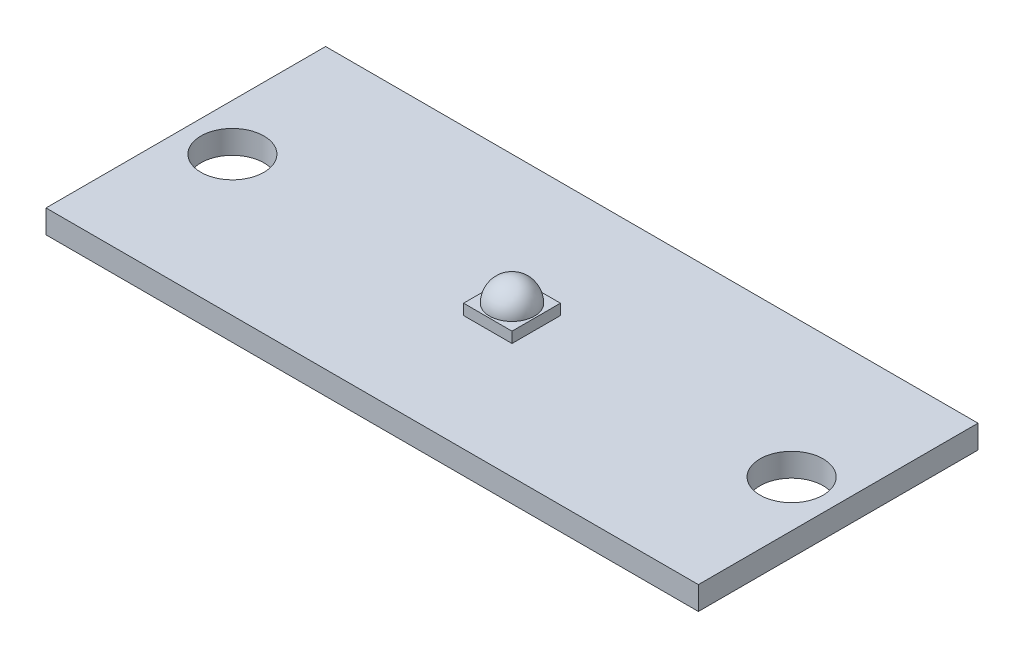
ISO-10303-21;
HEADER;
FILE_DESCRIPTION(('STEP AP214'),'2;1');
FILE_NAME('part.step','',(''),(''),'','','');
FILE_SCHEMA(('AUTOMOTIVE_DESIGN { 1 0 10303 214 1 1 1 1 }'));
ENDSEC;
DATA;
#1=APPLICATION_CONTEXT('core data for automotive mechanical design processes');
#2=APPLICATION_PROTOCOL_DEFINITION('international standard','automotive_design',2000,#1);
#3=PRODUCT_CONTEXT('',#1,'mechanical');
#4=PRODUCT('Part','Part','',(#3));
#5=PRODUCT_RELATED_PRODUCT_CATEGORY('part','',(#4));
#6=PRODUCT_DEFINITION_FORMATION('','',#4);
#7=PRODUCT_DEFINITION_CONTEXT('part definition',#1,'design');
#8=PRODUCT_DEFINITION('design','',#6,#7);
#9=PRODUCT_DEFINITION_SHAPE('','',#8);
#10=(LENGTH_UNIT() NAMED_UNIT(*) SI_UNIT(.MILLI.,.METRE.));
#11=(NAMED_UNIT(*) PLANE_ANGLE_UNIT() SI_UNIT($,.RADIAN.));
#12=(NAMED_UNIT(*) SI_UNIT($,.STERADIAN.) SOLID_ANGLE_UNIT());
#13=UNCERTAINTY_MEASURE_WITH_UNIT(LENGTH_MEASURE(1.E-05),#10,'distance_accuracy_value','');
#14=(GEOMETRIC_REPRESENTATION_CONTEXT(3) GLOBAL_UNCERTAINTY_ASSIGNED_CONTEXT((#13)) GLOBAL_UNIT_ASSIGNED_CONTEXT((#10,
#11,#12)) REPRESENTATION_CONTEXT('',''));
#15=CARTESIAN_POINT('',(0.,0.,0.));
#16=DIRECTION('',(0.,0.,1.));
#17=DIRECTION('',(1.,0.,0.));
#18=AXIS2_PLACEMENT_3D('',#15,#16,#17);
#19=CARTESIAN_POINT('',(0.,1.5875,0.));
#20=DIRECTION('',(0.,-1.,0.));
#21=DIRECTION('',(0.,0.,-1.));
#22=AXIS2_PLACEMENT_3D('',#19,#20,#21);
#23=PLANE('',#22);
#24=CARTESIAN_POINT('',(19.05,1.5875,0.));
#25=DIRECTION('',(0.,1.,0.));
#26=DIRECTION('',(0.,0.,1.));
#27=AXIS2_PLACEMENT_3D('',#24,#25,#26);
#28=CIRCLE('',#27,2.1463);
#29=CARTESIAN_POINT('',(19.05,1.5875,2.14629999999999));
#30=VERTEX_POINT('',#29);
#31=EDGE_CURVE('E123',#30,#30,#28,.T.);
#32=ORIENTED_EDGE('',*,*,#31,.F.);
#33=EDGE_LOOP('',(#32));
#34=FACE_BOUND('',#33,.T.);
#35=DIRECTION('',(0.,0.,-1.));
#36=VECTOR('',#35,1.);
#37=CARTESIAN_POINT('',(22.225,1.5875,9.525));
#38=LINE('',#37,#36);
#39=CARTESIAN_POINT('',(22.225,1.5875,9.525));
#40=VERTEX_POINT('',#39);
#41=CARTESIAN_POINT('',(22.225,1.5875,-9.525));
#42=VERTEX_POINT('',#41);
#43=EDGE_CURVE('E138',#40,#42,#38,.T.);
#44=ORIENTED_EDGE('',*,*,#43,.T.);
#45=DIRECTION('',(-1.,0.,0.));
#46=VECTOR('',#45,1.);
#47=CARTESIAN_POINT('',(-22.225,1.5875,-9.525));
#48=LINE('',#47,#46);
#49=CARTESIAN_POINT('',(-22.225,1.5875,-9.525));
#50=VERTEX_POINT('',#49);
#51=EDGE_CURVE('E141',#42,#50,#48,.T.);
#52=ORIENTED_EDGE('',*,*,#51,.T.);
#53=DIRECTION('',(0.,0.,1.));
#54=VECTOR('',#53,1.);
#55=CARTESIAN_POINT('',(-22.225,1.5875,9.525));
#56=LINE('',#55,#54);
#57=CARTESIAN_POINT('',(-22.225,1.5875,9.525));
#58=VERTEX_POINT('',#57);
#59=EDGE_CURVE('E144',#50,#58,#56,.T.);
#60=ORIENTED_EDGE('',*,*,#59,.T.);
#61=DIRECTION('',(1.,0.,0.));
#62=VECTOR('',#61,1.);
#63=CARTESIAN_POINT('',(-22.225,1.5875,9.525));
#64=LINE('',#63,#62);
#65=EDGE_CURVE('E146',#58,#40,#64,.T.);
#66=ORIENTED_EDGE('',*,*,#65,.T.);
#67=EDGE_LOOP('',(#44,#52,#60,#66));
#68=FACE_BOUND('',#67,.T.);
#69=CARTESIAN_POINT('',(-19.05,1.5875,0.));
#70=DIRECTION('',(0.,1.,0.));
#71=DIRECTION('',(0.,0.,1.));
#72=AXIS2_PLACEMENT_3D('',#69,#70,#71);
#73=CIRCLE('',#72,2.1463);
#74=CARTESIAN_POINT('',(-19.05,1.5875,2.1463));
#75=VERTEX_POINT('',#74);
#76=EDGE_CURVE('E132',#75,#75,#73,.T.);
#77=ORIENTED_EDGE('',*,*,#76,.F.);
#78=EDGE_LOOP('',(#77));
#79=FACE_BOUND('',#78,.T.);
#80=DIRECTION('',(0.,0.,1.));
#81=VECTOR('',#80,1.);
#82=CARTESIAN_POINT('',(-1.65,1.5875,1.65));
#83=LINE('',#82,#81);
#84=CARTESIAN_POINT('',(-1.65,1.5875,-1.65));
#85=VERTEX_POINT('',#84);
#86=CARTESIAN_POINT('',(-1.65,1.5875,1.65));
#87=VERTEX_POINT('',#86);
#88=EDGE_CURVE('E119',#85,#87,#83,.T.);
#89=ORIENTED_EDGE('',*,*,#88,.F.);
#90=DIRECTION('',(-1.,0.,0.));
#91=VECTOR('',#90,1.);
#92=CARTESIAN_POINT('',(1.65,1.5875,-1.65));
#93=LINE('',#92,#91);
#94=CARTESIAN_POINT('',(1.65,1.5875,-1.65));
#95=VERTEX_POINT('',#94);
#96=EDGE_CURVE('E116',#95,#85,#93,.T.);
#97=ORIENTED_EDGE('',*,*,#96,.F.);
#98=DIRECTION('',(0.,0.,-1.));
#99=VECTOR('',#98,1.);
#100=CARTESIAN_POINT('',(1.65,1.5875,1.65));
#101=LINE('',#100,#99);
#102=CARTESIAN_POINT('',(1.65,1.5875,1.65));
#103=VERTEX_POINT('',#102);
#104=EDGE_CURVE('E54',#103,#95,#101,.T.);
#105=ORIENTED_EDGE('',*,*,#104,.F.);
#106=DIRECTION('',(1.,0.,0.));
#107=VECTOR('',#106,1.);
#108=CARTESIAN_POINT('',(1.65,1.5875,1.65));
#109=LINE('',#108,#107);
#110=EDGE_CURVE('E49',#87,#103,#109,.T.);
#111=ORIENTED_EDGE('',*,*,#110,.F.);
#112=EDGE_LOOP('',(#89,#97,#105,#111));
#113=FACE_BOUND('',#112,.T.);
#114=ADVANCED_FACE('F34',(#34,#68,#79,#113),#23,.F.);
#115=CARTESIAN_POINT('',(0.,0.,0.));
#116=DIRECTION('',(0.,-1.,0.));
#117=DIRECTION('',(0.,0.,-1.));
#118=AXIS2_PLACEMENT_3D('',#115,#116,#117);
#119=PLANE('',#118);
#120=CARTESIAN_POINT('',(-19.05,0.,0.));
#121=DIRECTION('',(0.,1.,0.));
#122=DIRECTION('',(0.,0.,1.));
#123=AXIS2_PLACEMENT_3D('',#120,#121,#122);
#124=CIRCLE('',#123,2.1463);
#125=CARTESIAN_POINT('',(-19.05,0.,2.1463));
#126=VERTEX_POINT('',#125);
#127=EDGE_CURVE('E130',#126,#126,#124,.T.);
#128=ORIENTED_EDGE('',*,*,#127,.T.);
#129=EDGE_LOOP('',(#128));
#130=FACE_BOUND('',#129,.T.);
#131=DIRECTION('',(0.,0.,-1.));
#132=VECTOR('',#131,1.);
#133=CARTESIAN_POINT('',(22.225,0.,9.525));
#134=LINE('',#133,#132);
#135=CARTESIAN_POINT('',(22.225,0.,9.525));
#136=VERTEX_POINT('',#135);
#137=CARTESIAN_POINT('',(22.225,0.,-9.525));
#138=VERTEX_POINT('',#137);
#139=EDGE_CURVE('E135',#136,#138,#134,.T.);
#140=ORIENTED_EDGE('',*,*,#139,.F.);
#141=DIRECTION('',(1.,0.,0.));
#142=VECTOR('',#141,1.);
#143=CARTESIAN_POINT('',(-22.225,0.,9.525));
#144=LINE('',#143,#142);
#145=CARTESIAN_POINT('',(-22.225,0.,9.525));
#146=VERTEX_POINT('',#145);
#147=EDGE_CURVE('E142',#146,#136,#144,.T.);
#148=ORIENTED_EDGE('',*,*,#147,.F.);
#149=DIRECTION('',(0.,0.,1.));
#150=VECTOR('',#149,1.);
#151=CARTESIAN_POINT('',(-22.225,0.,9.525));
#152=LINE('',#151,#150);
#153=CARTESIAN_POINT('',(-22.225,0.,-9.525));
#154=VERTEX_POINT('',#153);
#155=EDGE_CURVE('E153',#154,#146,#152,.T.);
#156=ORIENTED_EDGE('',*,*,#155,.F.);
#157=DIRECTION('',(-1.,0.,0.));
#158=VECTOR('',#157,1.);
#159=CARTESIAN_POINT('',(-22.225,0.,-9.525));
#160=LINE('',#159,#158);
#161=EDGE_CURVE('E151',#138,#154,#160,.T.);
#162=ORIENTED_EDGE('',*,*,#161,.F.);
#163=EDGE_LOOP('',(#140,#148,#156,#162));
#164=FACE_BOUND('',#163,.T.);
#165=CARTESIAN_POINT('',(19.05,0.,0.));
#166=DIRECTION('',(0.,1.,0.));
#167=DIRECTION('',(0.,0.,1.));
#168=AXIS2_PLACEMENT_3D('',#165,#166,#167);
#169=CIRCLE('',#168,2.1463);
#170=CARTESIAN_POINT('',(19.05,0.,2.14629999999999));
#171=VERTEX_POINT('',#170);
#172=EDGE_CURVE('E120',#171,#171,#169,.T.);
#173=ORIENTED_EDGE('',*,*,#172,.T.);
#174=EDGE_LOOP('',(#173));
#175=FACE_BOUND('',#174,.T.);
#176=ADVANCED_FACE('F174',(#130,#164,#175),#119,.T.);
#177=CARTESIAN_POINT('',(22.225,1.5875,9.525));
#178=DIRECTION('',(-1.,0.,0.));
#179=DIRECTION('',(0.,0.,1.));
#180=AXIS2_PLACEMENT_3D('',#177,#178,#179);
#181=PLANE('',#180);
#182=ORIENTED_EDGE('',*,*,#139,.T.);
#183=DIRECTION('',(0.,-1.,0.));
#184=VECTOR('',#183,1.);
#185=CARTESIAN_POINT('',(22.225,1.5875,-9.525));
#186=LINE('',#185,#184);
#187=EDGE_CURVE('E42',#42,#138,#186,.T.);
#188=ORIENTED_EDGE('',*,*,#187,.F.);
#189=ORIENTED_EDGE('',*,*,#43,.F.);
#190=DIRECTION('',(0.,-1.,0.));
#191=VECTOR('',#190,1.);
#192=CARTESIAN_POINT('',(22.225,1.5875,9.525));
#193=LINE('',#192,#191);
#194=EDGE_CURVE('E148',#40,#136,#193,.T.);
#195=ORIENTED_EDGE('',*,*,#194,.T.);
#196=EDGE_LOOP('',(#182,#188,#189,#195));
#197=FACE_BOUND('',#196,.T.);
#198=ADVANCED_FACE('F36',(#197),#181,.F.);
#199=CARTESIAN_POINT('',(-22.225,1.5875,-9.525));
#200=DIRECTION('',(0.,0.,1.));
#201=DIRECTION('',(1.,0.,0.));
#202=AXIS2_PLACEMENT_3D('',#199,#200,#201);
#203=PLANE('',#202);
#204=ORIENTED_EDGE('',*,*,#161,.T.);
#205=DIRECTION('',(0.,-1.,0.));
#206=VECTOR('',#205,1.);
#207=CARTESIAN_POINT('',(-22.225,1.5875,-9.525));
#208=LINE('',#207,#206);
#209=EDGE_CURVE('E161',#50,#154,#208,.T.);
#210=ORIENTED_EDGE('',*,*,#209,.F.);
#211=ORIENTED_EDGE('',*,*,#51,.F.);
#212=ORIENTED_EDGE('',*,*,#187,.T.);
#213=EDGE_LOOP('',(#204,#210,#211,#212));
#214=FACE_BOUND('',#213,.T.);
#215=ADVANCED_FACE('F166',(#214),#203,.F.);
#216=CARTESIAN_POINT('',(-22.225,1.5875,9.525));
#217=DIRECTION('',(1.,0.,0.));
#218=DIRECTION('',(0.,0.,-1.));
#219=AXIS2_PLACEMENT_3D('',#216,#217,#218);
#220=PLANE('',#219);
#221=ORIENTED_EDGE('',*,*,#155,.T.);
#222=DIRECTION('',(0.,-1.,0.));
#223=VECTOR('',#222,1.);
#224=CARTESIAN_POINT('',(-22.225,1.5875,9.525));
#225=LINE('',#224,#223);
#226=EDGE_CURVE('E158',#58,#146,#225,.T.);
#227=ORIENTED_EDGE('',*,*,#226,.F.);
#228=ORIENTED_EDGE('',*,*,#59,.F.);
#229=ORIENTED_EDGE('',*,*,#209,.T.);
#230=EDGE_LOOP('',(#221,#227,#228,#229));
#231=FACE_BOUND('',#230,.T.);
#232=ADVANCED_FACE('F179',(#231),#220,.F.);
#233=CARTESIAN_POINT('',(-22.225,1.5875,9.525));
#234=DIRECTION('',(0.,0.,-1.));
#235=DIRECTION('',(-1.,0.,0.));
#236=AXIS2_PLACEMENT_3D('',#233,#234,#235);
#237=PLANE('',#236);
#238=ORIENTED_EDGE('',*,*,#147,.T.);
#239=ORIENTED_EDGE('',*,*,#194,.F.);
#240=ORIENTED_EDGE('',*,*,#65,.F.);
#241=ORIENTED_EDGE('',*,*,#226,.T.);
#242=EDGE_LOOP('',(#238,#239,#240,#241));
#243=FACE_BOUND('',#242,.T.);
#244=ADVANCED_FACE('F183',(#243),#237,.F.);
#245=CARTESIAN_POINT('',(-19.05,1.5875,0.));
#246=DIRECTION('',(0.,-1.,0.));
#247=DIRECTION('',(0.,0.,-1.));
#248=AXIS2_PLACEMENT_3D('',#245,#246,#247);
#249=CYLINDRICAL_SURFACE('',#248,2.1463);
#250=ORIENTED_EDGE('',*,*,#76,.T.);
#251=EDGE_LOOP('',(#250));
#252=FACE_BOUND('',#251,.T.);
#253=ORIENTED_EDGE('',*,*,#127,.F.);
#254=EDGE_LOOP('',(#253));
#255=FACE_BOUND('',#254,.T.);
#256=ADVANCED_FACE('F220',(#252,#255),#249,.F.);
#257=CARTESIAN_POINT('',(19.05,1.5875,0.));
#258=DIRECTION('',(0.,-1.,0.));
#259=DIRECTION('',(0.,0.,-1.));
#260=AXIS2_PLACEMENT_3D('',#257,#258,#259);
#261=CYLINDRICAL_SURFACE('',#260,2.1463);
#262=ORIENTED_EDGE('',*,*,#31,.T.);
#263=EDGE_LOOP('',(#262));
#264=FACE_BOUND('',#263,.T.);
#265=ORIENTED_EDGE('',*,*,#172,.F.);
#266=EDGE_LOOP('',(#265));
#267=FACE_BOUND('',#266,.T.);
#268=ADVANCED_FACE('F217',(#264,#267),#261,.F.);
#269=CARTESIAN_POINT('',(-1.65,2.3175,1.65));
#270=DIRECTION('',(1.,0.,0.));
#271=DIRECTION('',(0.,0.,-1.));
#272=AXIS2_PLACEMENT_3D('',#269,#270,#271);
#273=PLANE('',#272);
#274=ORIENTED_EDGE('',*,*,#88,.T.);
#275=DIRECTION('',(0.,-1.,0.));
#276=VECTOR('',#275,1.);
#277=CARTESIAN_POINT('',(-1.65,2.3175,1.65));
#278=LINE('',#277,#276);
#279=CARTESIAN_POINT('',(-1.65,2.3175,1.65));
#280=VERTEX_POINT('',#279);
#281=EDGE_CURVE('E100',#280,#87,#278,.T.);
#282=ORIENTED_EDGE('',*,*,#281,.F.);
#283=DIRECTION('',(0.,0.,1.));
#284=VECTOR('',#283,1.);
#285=CARTESIAN_POINT('',(-1.65,2.3175,1.65));
#286=LINE('',#285,#284);
#287=CARTESIAN_POINT('',(-1.65,2.3175,-1.65));
#288=VERTEX_POINT('',#287);
#289=EDGE_CURVE('E107',#288,#280,#286,.T.);
#290=ORIENTED_EDGE('',*,*,#289,.F.);
#291=DIRECTION('',(0.,-1.,0.));
#292=VECTOR('',#291,1.);
#293=CARTESIAN_POINT('',(-1.65,2.3175,-1.65));
#294=LINE('',#293,#292);
#295=EDGE_CURVE('E195',#288,#85,#294,.T.);
#296=ORIENTED_EDGE('',*,*,#295,.T.);
#297=EDGE_LOOP('',(#274,#282,#290,#296));
#298=FACE_BOUND('',#297,.T.);
#299=ADVANCED_FACE('F118',(#298),#273,.F.);
#300=CARTESIAN_POINT('',(1.65,2.3175,1.65));
#301=DIRECTION('',(0.,0.,-1.));
#302=DIRECTION('',(-1.,0.,0.));
#303=AXIS2_PLACEMENT_3D('',#300,#301,#302);
#304=PLANE('',#303);
#305=ORIENTED_EDGE('',*,*,#110,.T.);
#306=DIRECTION('',(0.,-1.,0.));
#307=VECTOR('',#306,1.);
#308=CARTESIAN_POINT('',(1.65,2.3175,1.65));
#309=LINE('',#308,#307);
#310=CARTESIAN_POINT('',(1.65,2.3175,1.65));
#311=VERTEX_POINT('',#310);
#312=EDGE_CURVE('E103',#311,#103,#309,.T.);
#313=ORIENTED_EDGE('',*,*,#312,.F.);
#314=DIRECTION('',(1.,0.,0.));
#315=VECTOR('',#314,1.);
#316=CARTESIAN_POINT('',(1.65,2.3175,1.65));
#317=LINE('',#316,#315);
#318=EDGE_CURVE('E96',#280,#311,#317,.T.);
#319=ORIENTED_EDGE('',*,*,#318,.F.);
#320=ORIENTED_EDGE('',*,*,#281,.T.);
#321=EDGE_LOOP('',(#305,#313,#319,#320));
#322=FACE_BOUND('',#321,.T.);
#323=ADVANCED_FACE('F98',(#322),#304,.F.);
#324=CARTESIAN_POINT('',(1.65,2.3175,1.65));
#325=DIRECTION('',(-1.,0.,0.));
#326=DIRECTION('',(0.,0.,1.));
#327=AXIS2_PLACEMENT_3D('',#324,#325,#326);
#328=PLANE('',#327);
#329=ORIENTED_EDGE('',*,*,#104,.T.);
#330=DIRECTION('',(0.,-1.,0.));
#331=VECTOR('',#330,1.);
#332=CARTESIAN_POINT('',(1.65,2.3175,-1.65));
#333=LINE('',#332,#331);
#334=CARTESIAN_POINT('',(1.65,2.3175,-1.65));
#335=VERTEX_POINT('',#334);
#336=EDGE_CURVE('E125',#335,#95,#333,.T.);
#337=ORIENTED_EDGE('',*,*,#336,.F.);
#338=DIRECTION('',(0.,0.,-1.));
#339=VECTOR('',#338,1.);
#340=CARTESIAN_POINT('',(1.65,2.3175,1.65));
#341=LINE('',#340,#339);
#342=EDGE_CURVE('E106',#311,#335,#341,.T.);
#343=ORIENTED_EDGE('',*,*,#342,.F.);
#344=ORIENTED_EDGE('',*,*,#312,.T.);
#345=EDGE_LOOP('',(#329,#337,#343,#344));
#346=FACE_BOUND('',#345,.T.);
#347=ADVANCED_FACE('F204',(#346),#328,.F.);
#348=CARTESIAN_POINT('',(1.65,2.3175,-1.65));
#349=DIRECTION('',(0.,0.,1.));
#350=DIRECTION('',(1.,0.,0.));
#351=AXIS2_PLACEMENT_3D('',#348,#349,#350);
#352=PLANE('',#351);
#353=ORIENTED_EDGE('',*,*,#96,.T.);
#354=ORIENTED_EDGE('',*,*,#295,.F.);
#355=DIRECTION('',(-1.,0.,0.));
#356=VECTOR('',#355,1.);
#357=CARTESIAN_POINT('',(1.65,2.3175,-1.65));
#358=LINE('',#357,#356);
#359=EDGE_CURVE('E112',#335,#288,#358,.T.);
#360=ORIENTED_EDGE('',*,*,#359,.F.);
#361=ORIENTED_EDGE('',*,*,#336,.T.);
#362=EDGE_LOOP('',(#353,#354,#360,#361));
#363=FACE_BOUND('',#362,.T.);
#364=ADVANCED_FACE('F194',(#363),#352,.F.);
#365=CARTESIAN_POINT('',(0.,2.3175,0.));
#366=DIRECTION('',(0.,1.,0.));
#367=DIRECTION('',(0.,0.,1.));
#368=AXIS2_PLACEMENT_3D('',#365,#366,#367);
#369=PLANE('',#368);
#370=CARTESIAN_POINT('',(0.,2.3175,0.));
#371=DIRECTION('',(0.,1.,0.));
#372=DIRECTION('',(0.,0.,1.));
#373=AXIS2_PLACEMENT_3D('',#370,#371,#372);
#374=CIRCLE('',#373,1.53);
#375=CARTESIAN_POINT('',(0.,2.3175,1.53));
#376=VERTEX_POINT('',#375);
#377=EDGE_CURVE('E11',#376,#376,#374,.T.);
#378=ORIENTED_EDGE('',*,*,#377,.F.);
#379=EDGE_LOOP('',(#378));
#380=FACE_BOUND('',#379,.T.);
#381=ORIENTED_EDGE('',*,*,#289,.T.);
#382=ORIENTED_EDGE('',*,*,#318,.T.);
#383=ORIENTED_EDGE('',*,*,#342,.T.);
#384=ORIENTED_EDGE('',*,*,#359,.T.);
#385=EDGE_LOOP('',(#381,#382,#383,#384));
#386=FACE_BOUND('',#385,.T.);
#387=ADVANCED_FACE('F110',(#380,#386),#369,.T.);
#388=CARTESIAN_POINT('',(0.,2.3175,0.));
#389=DIRECTION('',(0.,-1.,0.));
#390=DIRECTION('',(0.,0.,-1.));
#391=AXIS2_PLACEMENT_3D('',#388,#389,#390);
#392=SPHERICAL_SURFACE('',#391,1.53);
#393=ORIENTED_EDGE('',*,*,#377,.T.);
#394=EDGE_LOOP('',(#393));
#395=FACE_BOUND('',#394,.T.);
#396=ADVANCED_FACE('F280',(#395),#392,.T.);
#397=CLOSED_SHELL('',(#114,#176,#198,#215,#232,#244,#256,#268,#299,#323,#347,#364,#387,#396));
#398=MANIFOLD_SOLID_BREP('B2',#397);
#399=ADVANCED_BREP_SHAPE_REPRESENTATION('',(#18,#398),#14);
#400=SHAPE_DEFINITION_REPRESENTATION(#9,#399);
ENDSEC;
END-ISO-10303-21;
